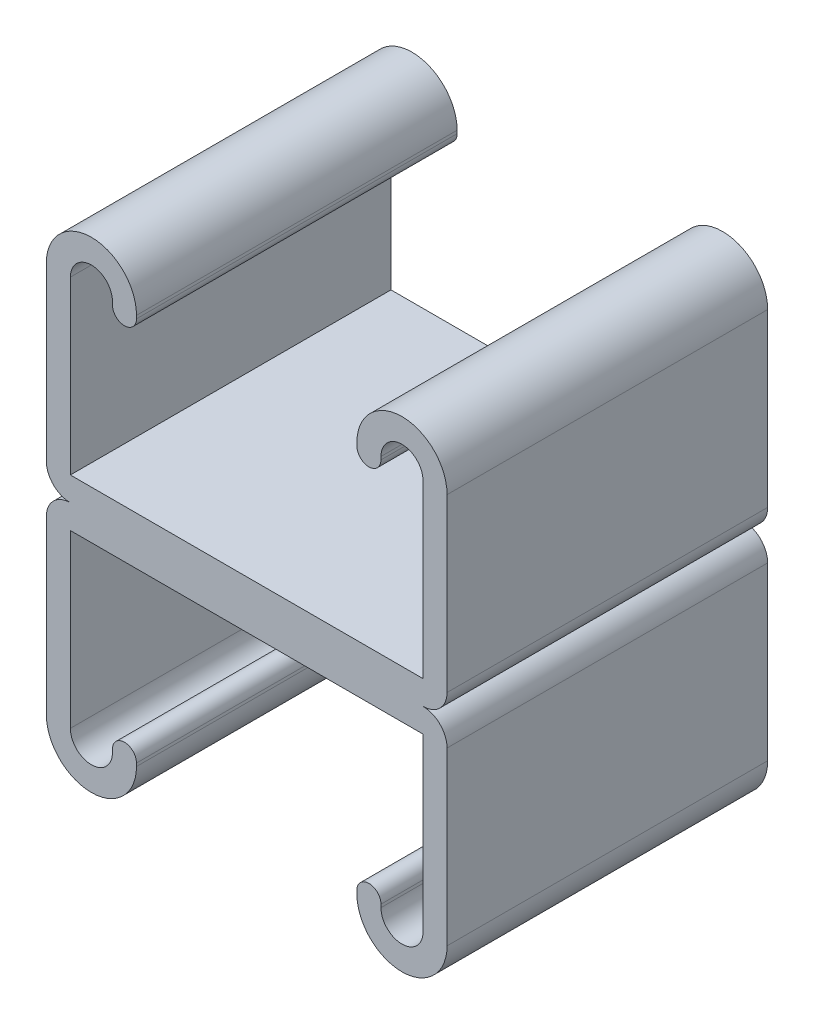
from build123d import *

# Parameters (mm, degrees)
BASE_EXTRUDE_DEPTH = 12.7


with BuildPart() as part:
    # Sketch1 → Base-Extrude (new, symmetric)
    with BuildSketch(Plane.XY):
        with BuildLine():
            Line((-15.875, 15.478125), (-15.875, 1.905))
            ThreePointArc((-15.875, 1.905), (-15.317038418, 0.557961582), (-13.97, 0))
            Line((-13.97, 0), (13.97, 0))
            ThreePointArc((13.97, 0), (15.317038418, 0.557961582), (15.875, 1.905))
            Line((15.875, 1.905), (15.875, 15.478125))
            ThreePointArc((15.875, 15.478125), (12.303125, 19.05), (8.73125, 15.478125))
            Line((8.73125, 15.478125), (8.73125, 15.24))
            ThreePointArc((8.73125, 15.24), (9.68375, 14.2875), (10.63625, 15.24))
            Line((10.63625, 15.24), (10.63625, 15.478125))
            ThreePointArc((10.63625, 15.478125), (12.303125, 17.145), (13.97, 15.478125))
            Line((13.97, 15.478125), (13.97, 1.905))
            Line((13.97, 1.905), (-13.97, 1.905))
            Line((-13.97, 1.905), (-13.97, 15.478125))
            ThreePointArc((-13.97, 15.478125), (-12.303125, 17.145), (-10.63625, 15.478125))
            Line((-10.63625, 15.478125), (-10.63625, 15.24))
            ThreePointArc((-10.63625, 15.24), (-9.68375, 14.2875), (-8.73125, 15.24))
            Line((-8.73125, 15.24), (-8.73125, 15.478125))
            ThreePointArc((-8.73125, 15.478125), (-12.303125, 19.05), (-15.875, 15.478125))
        make_face()
    base_extrude = extrude(amount=BASE_EXTRUDE_DEPTH, both=True)

    # Mirror1: Base-Extrude across plane
    add(base_extrude.mirror(Plane.ZX))


solid = part.part
